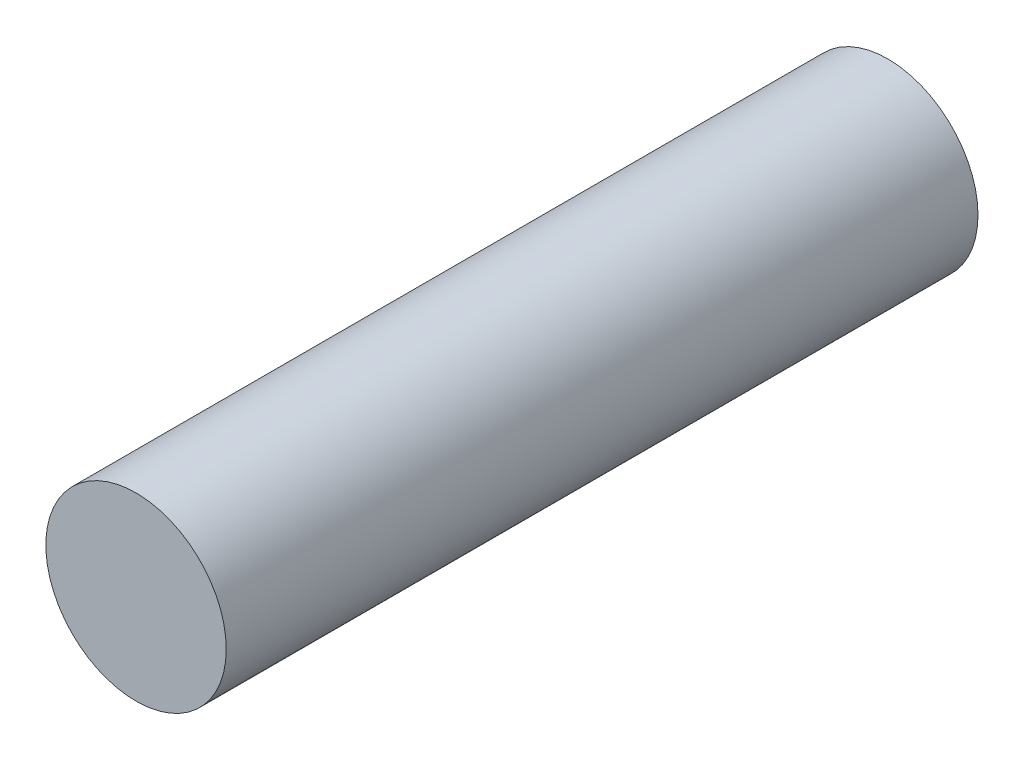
from build123d import *

# Parameters (mm, degrees)
ESQUISSE3_W = 12
ESQUISSE3_H = 100


with BuildPart() as part:
    # Esquisse3 → cylindre primitif (revolve)
    with BuildSketch(Plane(origin=(0, 0, 0), x_dir=(1, 0, 0), z_dir=(0, 1, 0)), mode=Mode.PRIVATE) as cylindre_primitif_sk:
        with Locations((-6, 0)):
            Rectangle(ESQUISSE3_W, ESQUISSE3_H)
    revolve(cylindre_primitif_sk.sketch.rotate(Axis((0, 0, 50), (0, 0, -1)), 180), axis=Axis((0, 0, 50), (0, 0, -1)))


solid = part.part
